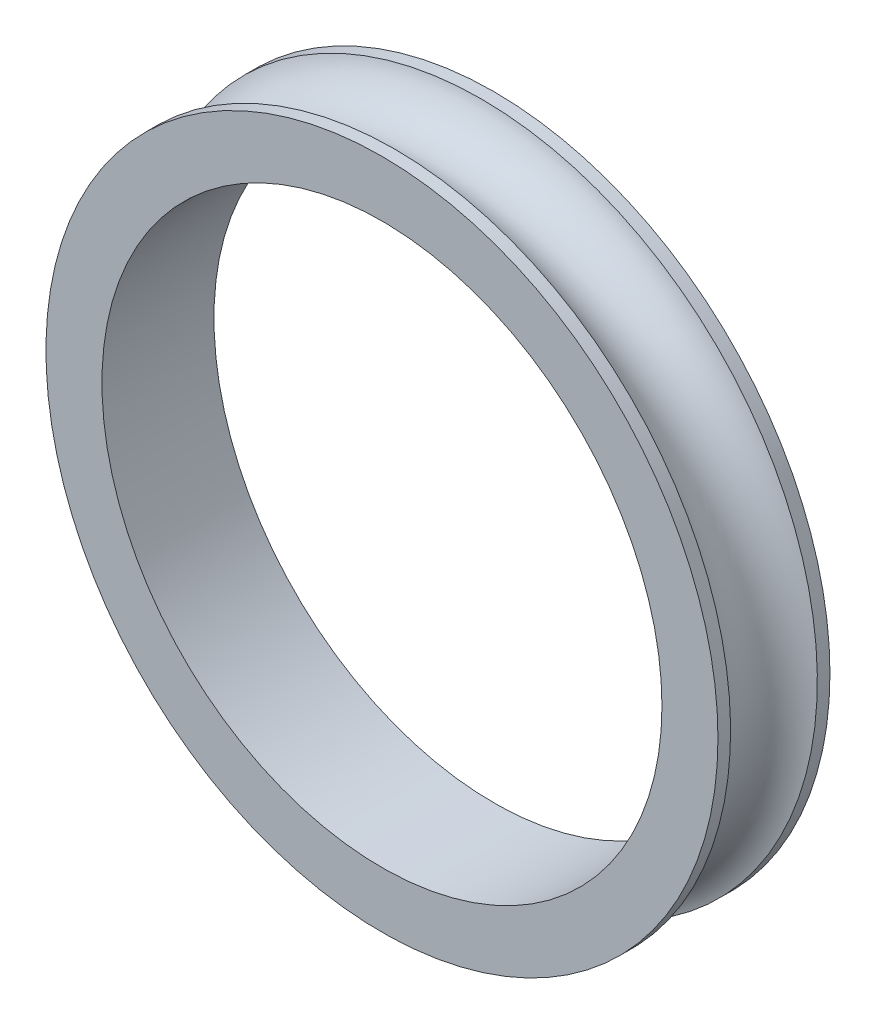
ISO-10303-21;
HEADER;
FILE_DESCRIPTION(('STEP AP214'),'2;1');
FILE_NAME('part.step','',(''),(''),'','','');
FILE_SCHEMA(('AUTOMOTIVE_DESIGN { 1 0 10303 214 1 1 1 1 }'));
ENDSEC;
DATA;
#1=APPLICATION_CONTEXT('core data for automotive mechanical design processes');
#2=APPLICATION_PROTOCOL_DEFINITION('international standard','automotive_design',2000,#1);
#3=PRODUCT_CONTEXT('',#1,'mechanical');
#4=PRODUCT('Part','Part','',(#3));
#5=PRODUCT_RELATED_PRODUCT_CATEGORY('part','',(#4));
#6=PRODUCT_DEFINITION_FORMATION('','',#4);
#7=PRODUCT_DEFINITION_CONTEXT('part definition',#1,'design');
#8=PRODUCT_DEFINITION('design','',#6,#7);
#9=PRODUCT_DEFINITION_SHAPE('','',#8);
#10=(LENGTH_UNIT() NAMED_UNIT(*) SI_UNIT(.MILLI.,.METRE.));
#11=(NAMED_UNIT(*) PLANE_ANGLE_UNIT() SI_UNIT($,.RADIAN.));
#12=(NAMED_UNIT(*) SI_UNIT($,.STERADIAN.) SOLID_ANGLE_UNIT());
#13=UNCERTAINTY_MEASURE_WITH_UNIT(LENGTH_MEASURE(1.E-05),#10,'distance_accuracy_value','');
#14=(GEOMETRIC_REPRESENTATION_CONTEXT(3) GLOBAL_UNCERTAINTY_ASSIGNED_CONTEXT((#13)) GLOBAL_UNIT_ASSIGNED_CONTEXT((#10,
#11,#12)) REPRESENTATION_CONTEXT('',''));
#15=CARTESIAN_POINT('',(0.,0.,0.));
#16=DIRECTION('',(0.,0.,1.));
#17=DIRECTION('',(1.,0.,0.));
#18=AXIS2_PLACEMENT_3D('',#15,#16,#17);
#19=CARTESIAN_POINT('',(0.,0.,10.));
#20=DIRECTION('',(0.,0.,-1.));
#21=DIRECTION('',(-1.,0.,0.));
#22=AXIS2_PLACEMENT_3D('',#19,#20,#21);
#23=CYLINDRICAL_SURFACE('',#22,30.);
#24=CARTESIAN_POINT('',(0.,0.,0.));
#25=DIRECTION('',(0.,0.,1.));
#26=DIRECTION('',(1.,0.,0.));
#27=AXIS2_PLACEMENT_3D('',#24,#25,#26);
#28=CIRCLE('',#27,30.);
#29=CARTESIAN_POINT('',(30.,0.,0.));
#30=VERTEX_POINT('',#29);
#31=EDGE_CURVE('E36',#30,#30,#28,.T.);
#32=ORIENTED_EDGE('',*,*,#31,.T.);
#33=EDGE_LOOP('',(#32));
#34=FACE_BOUND('',#33,.T.);
#35=CARTESIAN_POINT('',(0.,0.,1.12701665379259));
#36=DIRECTION('',(0.,0.,-1.));
#37=DIRECTION('',(0.,1.,0.));
#38=AXIS2_PLACEMENT_3D('',#35,#36,#37);
#39=CIRCLE('',#38,30.);
#40=CARTESIAN_POINT('',(0.,30.,1.12701665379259));
#41=VERTEX_POINT('',#40);
#42=EDGE_CURVE('E53',#41,#41,#39,.T.);
#43=ORIENTED_EDGE('',*,*,#42,.T.);
#44=EDGE_LOOP('',(#43));
#45=FACE_BOUND('',#44,.T.);
#46=ADVANCED_FACE('F33',(#34,#45),#23,.T.);
#47=CARTESIAN_POINT('',(0.,0.,10.));
#48=DIRECTION('',(0.,0.,1.));
#49=DIRECTION('',(1.,0.,0.));
#50=AXIS2_PLACEMENT_3D('',#47,#48,#49);
#51=CIRCLE('',#50,30.);
#52=CARTESIAN_POINT('',(30.,0.,10.));
#53=VERTEX_POINT('',#52);
#54=EDGE_CURVE('E10',#53,#53,#51,.T.);
#55=ORIENTED_EDGE('',*,*,#54,.F.);
#56=EDGE_LOOP('',(#55));
#57=FACE_BOUND('',#56,.T.);
#58=CARTESIAN_POINT('',(0.,0.,8.87298334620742));
#59=DIRECTION('',(0.,0.,-1.));
#60=DIRECTION('',(0.,1.,0.));
#61=AXIS2_PLACEMENT_3D('',#58,#59,#60);
#62=CIRCLE('',#61,30.);
#63=CARTESIAN_POINT('',(0.,30.,8.87298334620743));
#64=VERTEX_POINT('',#63);
#65=EDGE_CURVE('E48',#64,#64,#62,.T.);
#66=ORIENTED_EDGE('',*,*,#65,.F.);
#67=EDGE_LOOP('',(#66));
#68=FACE_BOUND('',#67,.T.);
#69=ADVANCED_FACE('F70',(#57,#68),#23,.T.);
#70=CARTESIAN_POINT('',(0.,0.,10.));
#71=DIRECTION('',(0.,0.,1.));
#72=DIRECTION('',(1.,0.,0.));
#73=AXIS2_PLACEMENT_3D('',#70,#71,#72);
#74=PLANE('',#73);
#75=CARTESIAN_POINT('',(0.,0.,10.));
#76=DIRECTION('',(0.,0.,1.));
#77=DIRECTION('',(1.,0.,0.));
#78=AXIS2_PLACEMENT_3D('',#75,#76,#77);
#79=CIRCLE('',#78,25.);
#80=CARTESIAN_POINT('',(25.,0.,10.));
#81=VERTEX_POINT('',#80);
#82=EDGE_CURVE('E43',#81,#81,#79,.T.);
#83=ORIENTED_EDGE('',*,*,#82,.F.);
#84=EDGE_LOOP('',(#83));
#85=FACE_BOUND('',#84,.T.);
#86=ORIENTED_EDGE('',*,*,#54,.T.);
#87=EDGE_LOOP('',(#86));
#88=FACE_BOUND('',#87,.T.);
#89=ADVANCED_FACE('F75',(#85,#88),#74,.T.);
#90=CARTESIAN_POINT('',(0.,0.,0.));
#91=DIRECTION('',(0.,0.,1.));
#92=DIRECTION('',(1.,0.,0.));
#93=AXIS2_PLACEMENT_3D('',#90,#91,#92);
#94=PLANE('',#93);
#95=CARTESIAN_POINT('',(0.,0.,0.));
#96=DIRECTION('',(0.,0.,1.));
#97=DIRECTION('',(1.,0.,0.));
#98=AXIS2_PLACEMENT_3D('',#95,#96,#97);
#99=CIRCLE('',#98,25.);
#100=CARTESIAN_POINT('',(25.,0.,0.));
#101=VERTEX_POINT('',#100);
#102=EDGE_CURVE('E45',#101,#101,#99,.T.);
#103=ORIENTED_EDGE('',*,*,#102,.T.);
#104=EDGE_LOOP('',(#103));
#105=FACE_BOUND('',#104,.T.);
#106=ORIENTED_EDGE('',*,*,#31,.F.);
#107=EDGE_LOOP('',(#106));
#108=FACE_BOUND('',#107,.T.);
#109=ADVANCED_FACE('F66',(#105,#108),#94,.F.);
#110=CARTESIAN_POINT('',(0.,0.,10.));
#111=DIRECTION('',(0.,0.,-1.));
#112=DIRECTION('',(-1.,0.,0.));
#113=AXIS2_PLACEMENT_3D('',#110,#111,#112);
#114=CYLINDRICAL_SURFACE('',#113,25.);
#115=ORIENTED_EDGE('',*,*,#82,.T.);
#116=EDGE_LOOP('',(#115));
#117=FACE_BOUND('',#116,.T.);
#118=ORIENTED_EDGE('',*,*,#102,.F.);
#119=EDGE_LOOP('',(#118));
#120=FACE_BOUND('',#119,.T.);
#121=ADVANCED_FACE('F60',(#117,#120),#114,.F.);
#122=CARTESIAN_POINT('',(0.,0.,5.));
#123=DIRECTION('',(0.,0.,-1.));
#124=DIRECTION('',(0.,1.,0.));
#125=AXIS2_PLACEMENT_3D('',#122,#123,#124);
#126=TOROIDAL_SURFACE('',#125,31.,4.);
#127=ORIENTED_EDGE('',*,*,#65,.T.);
#128=EDGE_LOOP('',(#127));
#129=FACE_BOUND('',#128,.T.);
#130=ORIENTED_EDGE('',*,*,#42,.F.);
#131=EDGE_LOOP('',(#130));
#132=FACE_BOUND('',#131,.T.);
#133=ADVANCED_FACE('F58',(#129,#132),#126,.F.);
#134=CLOSED_SHELL('',(#46,#69,#89,#109,#121,#133));
#135=MANIFOLD_SOLID_BREP('B2',#134);
#136=ADVANCED_BREP_SHAPE_REPRESENTATION('',(#18,#135),#14);
#137=SHAPE_DEFINITION_REPRESENTATION(#9,#136);
ENDSEC;
END-ISO-10303-21;
